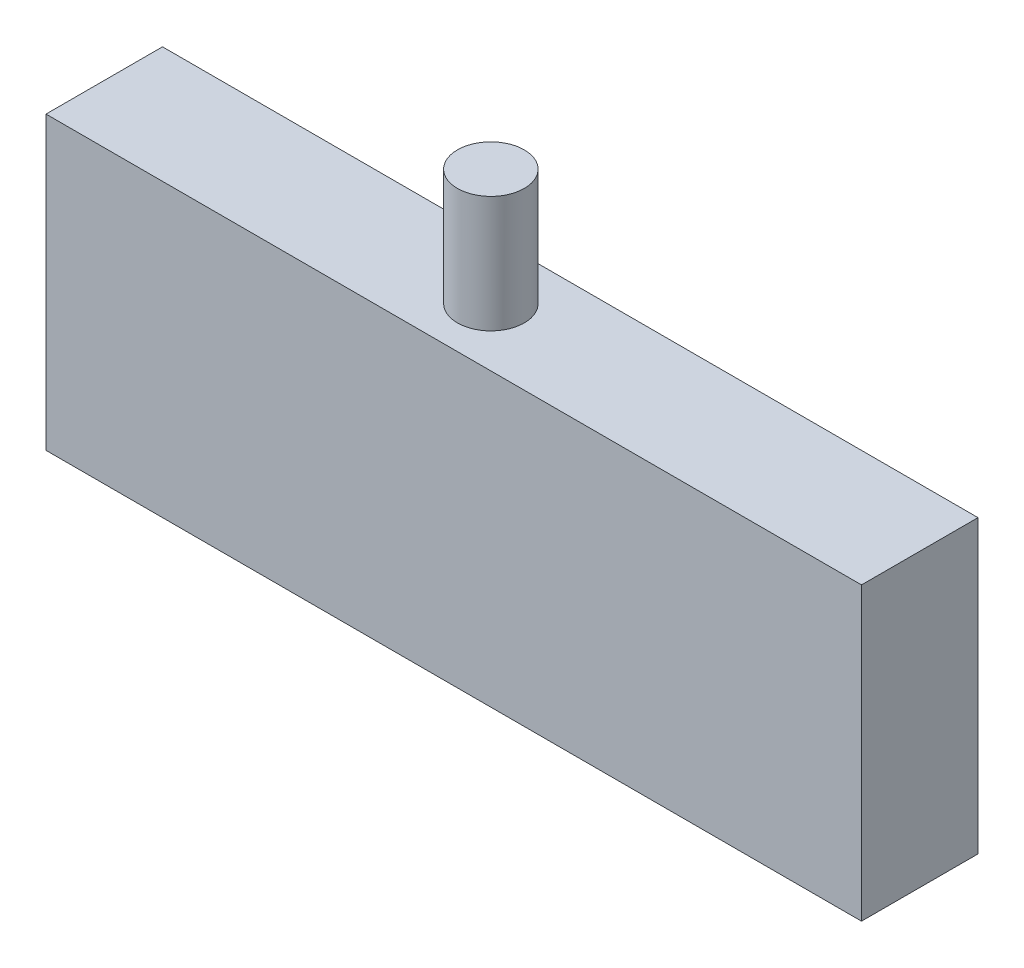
from build123d import *

# Parameters (mm, degrees)
SKETCH1_W           = 70
SKETCH1_H           = 25
BOSS_EXTRUDE1_DEPTH = 10
SKETCH2_R           = 2.868686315
BOSS_EXTRUDE2_DEPTH = 10


with BuildPart() as part:
    # Sketch1 → Boss-Extrude1 (new body)
    with BuildSketch(Plane.XY):
        with Locations((1.814159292, 7.079646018)):
            Rectangle(SKETCH1_W, SKETCH1_H)
    extrude(amount=BOSS_EXTRUDE1_DEPTH)

    # Sketch2 → Boss-Extrude2 (add)
    with BuildSketch(Plane(origin=(0, 19.579646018, 0), x_dir=(1, 0, 0), z_dir=(0, 1, 0))):
        with Locations(Location((0, -5, 0), (0, 0, 90))):
            Circle(SKETCH2_R)
    extrude(amount=BOSS_EXTRUDE2_DEPTH)


solid = part.part
